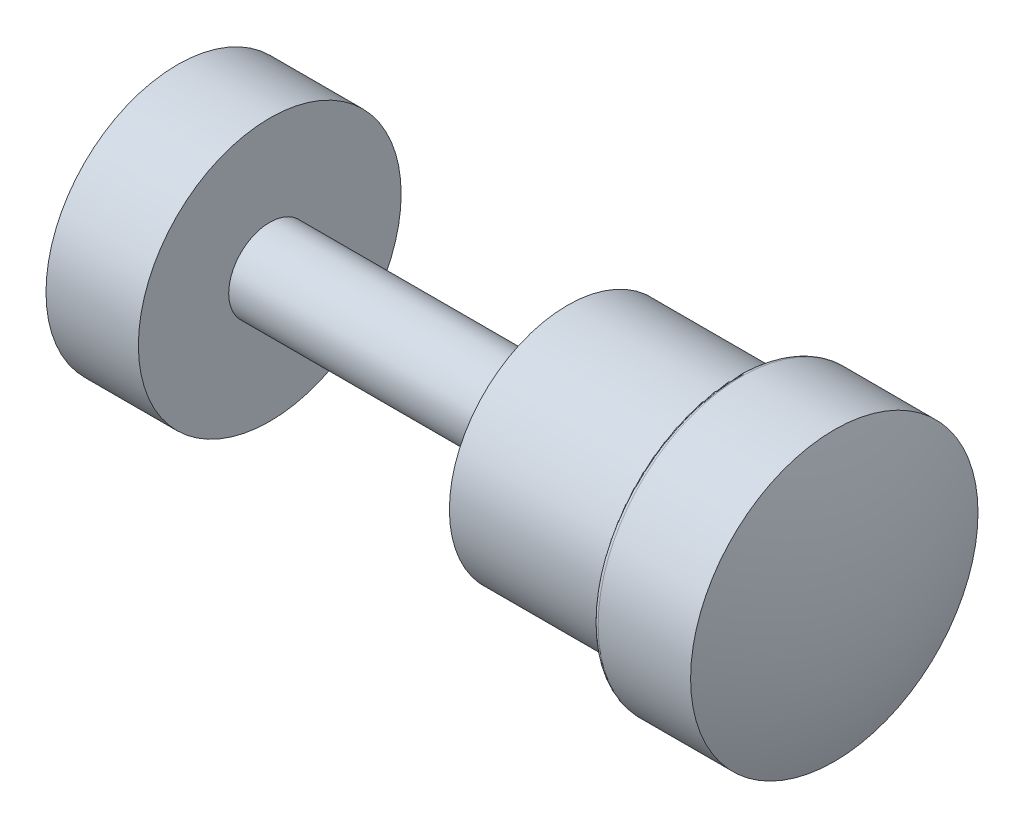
ISO-10303-21;
HEADER;
FILE_DESCRIPTION(('STEP AP214'),'2;1');
FILE_NAME('part.step','',(''),(''),'','','');
FILE_SCHEMA(('AUTOMOTIVE_DESIGN { 1 0 10303 214 1 1 1 1 }'));
ENDSEC;
DATA;
#1=APPLICATION_CONTEXT('core data for automotive mechanical design processes');
#2=APPLICATION_PROTOCOL_DEFINITION('international standard','automotive_design',2000,#1);
#3=PRODUCT_CONTEXT('',#1,'mechanical');
#4=PRODUCT('Part','Part','',(#3));
#5=PRODUCT_RELATED_PRODUCT_CATEGORY('part','',(#4));
#6=PRODUCT_DEFINITION_FORMATION('','',#4);
#7=PRODUCT_DEFINITION_CONTEXT('part definition',#1,'design');
#8=PRODUCT_DEFINITION('design','',#6,#7);
#9=PRODUCT_DEFINITION_SHAPE('','',#8);
#10=(LENGTH_UNIT() NAMED_UNIT(*) SI_UNIT(.MILLI.,.METRE.));
#11=(NAMED_UNIT(*) PLANE_ANGLE_UNIT() SI_UNIT($,.RADIAN.));
#12=(NAMED_UNIT(*) SI_UNIT($,.STERADIAN.) SOLID_ANGLE_UNIT());
#13=UNCERTAINTY_MEASURE_WITH_UNIT(LENGTH_MEASURE(1.E-05),#10,'distance_accuracy_value','');
#14=(GEOMETRIC_REPRESENTATION_CONTEXT(3) GLOBAL_UNCERTAINTY_ASSIGNED_CONTEXT((#13)) GLOBAL_UNIT_ASSIGNED_CONTEXT((#10,
#11,#12)) REPRESENTATION_CONTEXT('',''));
#15=CARTESIAN_POINT('',(0.,0.,0.));
#16=DIRECTION('',(0.,0.,1.));
#17=DIRECTION('',(1.,0.,0.));
#18=AXIS2_PLACEMENT_3D('',#15,#16,#17);
#19=CARTESIAN_POINT('',(-17.5,0.,0.));
#20=DIRECTION('',(1.,0.,0.));
#21=DIRECTION('',(0.,0.,-1.));
#22=AXIS2_PLACEMENT_3D('',#19,#20,#21);
#23=CYLINDRICAL_SURFACE('',#22,2.);
#24=CARTESIAN_POINT('',(0.,0.,0.));
#25=DIRECTION('',(1.,0.,0.));
#26=DIRECTION('',(0.,0.,-1.));
#27=AXIS2_PLACEMENT_3D('',#24,#25,#26);
#28=CIRCLE('',#27,2.);
#29=CARTESIAN_POINT('',(0.,0.,-2.));
#30=VERTEX_POINT('',#29);
#31=EDGE_CURVE('E40',#30,#30,#28,.F.);
#32=ORIENTED_EDGE('',*,*,#31,.T.);
#33=EDGE_LOOP('',(#32));
#34=FACE_BOUND('',#33,.T.);
#35=CARTESIAN_POINT('',(-14.5,0.,0.));
#36=DIRECTION('',(-1.,0.,0.));
#37=DIRECTION('',(0.,0.,1.));
#38=AXIS2_PLACEMENT_3D('',#35,#36,#37);
#39=CIRCLE('',#38,2.);
#40=CARTESIAN_POINT('',(-14.5,0.,2.));
#41=VERTEX_POINT('',#40);
#42=EDGE_CURVE('E10',#41,#41,#39,.T.);
#43=ORIENTED_EDGE('',*,*,#42,.F.);
#44=EDGE_LOOP('',(#43));
#45=FACE_BOUND('',#44,.T.);
#46=ADVANCED_FACE('F33',(#34,#45),#23,.T.);
#47=CARTESIAN_POINT('',(0.,0.,0.));
#48=DIRECTION('',(1.,0.,0.));
#49=DIRECTION('',(0.,0.,-1.));
#50=AXIS2_PLACEMENT_3D('',#47,#48,#49);
#51=PLANE('',#50);
#52=CARTESIAN_POINT('',(0.,0.,0.));
#53=DIRECTION('',(1.,0.,0.));
#54=DIRECTION('',(0.,0.,-1.));
#55=AXIS2_PLACEMENT_3D('',#52,#53,#54);
#56=CIRCLE('',#55,5.75);
#57=CARTESIAN_POINT('',(0.,0.,-5.75));
#58=VERTEX_POINT('',#57);
#59=EDGE_CURVE('E59',#58,#58,#56,.T.);
#60=ORIENTED_EDGE('',*,*,#59,.F.);
#61=EDGE_LOOP('',(#60));
#62=FACE_BOUND('',#61,.T.);
#63=ORIENTED_EDGE('',*,*,#31,.F.);
#64=EDGE_LOOP('',(#63));
#65=FACE_BOUND('',#64,.T.);
#66=ADVANCED_FACE('F95',(#62,#65),#51,.F.);
#67=CARTESIAN_POINT('',(8.,0.,0.));
#68=DIRECTION('',(-1.,0.,0.));
#69=DIRECTION('',(0.,0.,1.));
#70=AXIS2_PLACEMENT_3D('',#67,#68,#69);
#71=CYLINDRICAL_SURFACE('',#70,5.75);
#72=CARTESIAN_POINT('',(7.80290079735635,0.,0.));
#73=DIRECTION('',(1.,0.,0.));
#74=DIRECTION('',(0.,0.,-1.));
#75=AXIS2_PLACEMENT_3D('',#72,#73,#74);
#76=CIRCLE('',#75,5.75);
#77=CARTESIAN_POINT('',(7.80290079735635,0.,-5.75));
#78=VERTEX_POINT('',#77);
#79=EDGE_CURVE('E44',#78,#78,#76,.F.);
#80=ORIENTED_EDGE('',*,*,#79,.T.);
#81=EDGE_LOOP('',(#80));
#82=FACE_BOUND('',#81,.T.);
#83=ORIENTED_EDGE('',*,*,#59,.T.);
#84=EDGE_LOOP('',(#83));
#85=FACE_BOUND('',#84,.T.);
#86=ADVANCED_FACE('F100',(#82,#85),#71,.T.);
#87=CARTESIAN_POINT('',(13.,0.,0.));
#88=DIRECTION('',(-1.,0.,0.));
#89=DIRECTION('',(0.,0.,1.));
#90=AXIS2_PLACEMENT_3D('',#87,#88,#89);
#91=CYLINDRICAL_SURFACE('',#90,7.);
#92=CARTESIAN_POINT('',(8.49709920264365,0.,0.));
#93=DIRECTION('',(-1.,0.,0.));
#94=DIRECTION('',(0.,0.,1.));
#95=AXIS2_PLACEMENT_3D('',#92,#93,#94);
#96=CIRCLE('',#95,7.);
#97=CARTESIAN_POINT('',(8.49709920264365,0.,7.));
#98=VERTEX_POINT('',#97);
#99=EDGE_CURVE('E56',#98,#98,#96,.F.);
#100=ORIENTED_EDGE('',*,*,#99,.T.);
#101=EDGE_LOOP('',(#100));
#102=FACE_BOUND('',#101,.T.);
#103=CARTESIAN_POINT('',(13.,0.,0.));
#104=DIRECTION('',(1.,0.,0.));
#105=DIRECTION('',(0.,0.,-1.));
#106=AXIS2_PLACEMENT_3D('',#103,#104,#105);
#107=CIRCLE('',#106,7.);
#108=CARTESIAN_POINT('',(13.,0.,-7.));
#109=VERTEX_POINT('',#108);
#110=EDGE_CURVE('E60',#109,#109,#107,.T.);
#111=ORIENTED_EDGE('',*,*,#110,.F.);
#112=EDGE_LOOP('',(#111));
#113=FACE_BOUND('',#112,.T.);
#114=ADVANCED_FACE('F106',(#102,#113),#91,.T.);
#115=CARTESIAN_POINT('',(-5.97500000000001,0.,0.));
#116=DIRECTION('',(0.,0.,1.));
#117=DIRECTION('',(1.,0.,0.));
#118=AXIS2_PLACEMENT_3D('',#115,#116,#117);
#119=SPHERICAL_SURFACE('',#118,20.225);
#120=CARTESIAN_POINT('',(-5.97500000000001,0.,0.));
#121=DIRECTION('',(1.,0.,0.));
#122=DIRECTION('',(0.,0.,-1.));
#123=AXIS2_PLACEMENT_3D('',#120,#121,#122);
#124=SPHERICAL_SURFACE('',#123,20.225);
#125=ORIENTED_EDGE('',*,*,#110,.T.);
#126=EDGE_LOOP('',(#125));
#127=FACE_BOUND('',#126,.T.);
#128=ADVANCED_FACE('F108',(#127),#124,.T.);
#129=CARTESIAN_POINT('',(8.3,0.,0.));
#130=DIRECTION('',(1.,0.,0.));
#131=DIRECTION('',(0.,0.,-1.));
#132=AXIS2_PLACEMENT_3D('',#129,#130,#131);
#133=CONICAL_SURFACE('',#132,7.,1.33525134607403);
#134=CARTESIAN_POINT('',(8.25400237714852,0.,0.));
#135=DIRECTION('',(1.,0.,0.));
#136=DIRECTION('',(0.,0.,-1.));
#137=AXIS2_PLACEMENT_3D('',#134,#135,#136);
#138=CIRCLE('',#137,6.80834323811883);
#139=CARTESIAN_POINT('',(8.25400237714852,0.,-6.80834323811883));
#140=VERTEX_POINT('',#139);
#141=EDGE_CURVE('E48',#140,#140,#138,.F.);
#142=ORIENTED_EDGE('',*,*,#141,.T.);
#143=EDGE_LOOP('',(#142));
#144=FACE_BOUND('',#143,.T.);
#145=CARTESIAN_POINT('',(8.04599762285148,0.,0.));
#146=DIRECTION('',(-1.,0.,0.));
#147=DIRECTION('',(0.,0.,1.));
#148=AXIS2_PLACEMENT_3D('',#145,#146,#147);
#149=CIRCLE('',#148,5.94165676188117);
#150=CARTESIAN_POINT('',(8.04599762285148,0.,5.94165676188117));
#151=VERTEX_POINT('',#150);
#152=EDGE_CURVE('E53',#151,#151,#149,.F.);
#153=ORIENTED_EDGE('',*,*,#152,.T.);
#154=EDGE_LOOP('',(#153));
#155=FACE_BOUND('',#154,.T.);
#156=ADVANCED_FACE('F116',(#144,#155),#133,.T.);
#157=CARTESIAN_POINT('',(8.49709920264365,0.,0.));
#158=DIRECTION('',(-1.,0.,0.));
#159=DIRECTION('',(0.,0.,1.));
#160=AXIS2_PLACEMENT_3D('',#157,#158,#159);
#161=TOROIDAL_SURFACE('',#160,6.75,0.25);
#162=ORIENTED_EDGE('',*,*,#141,.F.);
#163=EDGE_LOOP('',(#162));
#164=FACE_BOUND('',#163,.T.);
#165=ORIENTED_EDGE('',*,*,#99,.F.);
#166=EDGE_LOOP('',(#165));
#167=FACE_BOUND('',#166,.T.);
#168=ADVANCED_FACE('F119',(#164,#167),#161,.T.);
#169=CARTESIAN_POINT('',(7.80290079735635,0.,0.));
#170=DIRECTION('',(1.,0.,0.));
#171=DIRECTION('',(0.,0.,-1.));
#172=AXIS2_PLACEMENT_3D('',#169,#170,#171);
#173=TOROIDAL_SURFACE('',#172,6.,0.25);
#174=ORIENTED_EDGE('',*,*,#79,.F.);
#175=EDGE_LOOP('',(#174));
#176=FACE_BOUND('',#175,.T.);
#177=ORIENTED_EDGE('',*,*,#152,.F.);
#178=EDGE_LOOP('',(#177));
#179=FACE_BOUND('',#178,.T.);
#180=ADVANCED_FACE('F35',(#176,#179),#173,.F.);
#181=CARTESIAN_POINT('',(-19.,0.,0.));
#182=DIRECTION('',(-1.,0.,0.));
#183=DIRECTION('',(0.,0.,1.));
#184=AXIS2_PLACEMENT_3D('',#181,#182,#183);
#185=PLANE('',#184);
#186=CARTESIAN_POINT('',(-19.,0.,0.));
#187=DIRECTION('',(-1.,0.,0.));
#188=DIRECTION('',(0.,0.,1.));
#189=AXIS2_PLACEMENT_3D('',#186,#187,#188);
#190=CIRCLE('',#189,6.4);
#191=CARTESIAN_POINT('',(-19.,0.,6.4));
#192=VERTEX_POINT('',#191);
#193=EDGE_CURVE('E68',#192,#192,#190,.T.);
#194=ORIENTED_EDGE('',*,*,#193,.T.);
#195=EDGE_LOOP('',(#194));
#196=FACE_BOUND('',#195,.T.);
#197=CARTESIAN_POINT('',(-19.,0.,0.));
#198=DIRECTION('',(-1.,0.,0.));
#199=DIRECTION('',(0.,0.,1.));
#200=AXIS2_PLACEMENT_3D('',#197,#198,#199);
#201=CIRCLE('',#200,2.);
#202=CARTESIAN_POINT('',(-19.,0.,2.));
#203=VERTEX_POINT('',#202);
#204=EDGE_CURVE('E72',#203,#203,#201,.T.);
#205=ORIENTED_EDGE('',*,*,#204,.F.);
#206=EDGE_LOOP('',(#205));
#207=FACE_BOUND('',#206,.T.);
#208=ADVANCED_FACE('F126',(#196,#207),#185,.T.);
#209=CARTESIAN_POINT('',(-19.,0.,0.));
#210=DIRECTION('',(1.,0.,0.));
#211=DIRECTION('',(0.,0.,-1.));
#212=AXIS2_PLACEMENT_3D('',#209,#210,#211);
#213=CYLINDRICAL_SURFACE('',#212,6.4);
#214=ORIENTED_EDGE('',*,*,#193,.F.);
#215=EDGE_LOOP('',(#214));
#216=FACE_BOUND('',#215,.T.);
#217=CARTESIAN_POINT('',(-14.5,0.,0.));
#218=DIRECTION('',(-1.,0.,0.));
#219=DIRECTION('',(0.,0.,1.));
#220=AXIS2_PLACEMENT_3D('',#217,#218,#219);
#221=CIRCLE('',#220,6.4);
#222=CARTESIAN_POINT('',(-14.5,0.,6.4));
#223=VERTEX_POINT('',#222);
#224=EDGE_CURVE('E75',#223,#223,#221,.T.);
#225=ORIENTED_EDGE('',*,*,#224,.T.);
#226=EDGE_LOOP('',(#225));
#227=FACE_BOUND('',#226,.T.);
#228=ADVANCED_FACE('F79',(#216,#227),#213,.T.);
#229=CARTESIAN_POINT('',(-19.,0.,0.));
#230=DIRECTION('',(1.,0.,0.));
#231=DIRECTION('',(0.,0.,-1.));
#232=AXIS2_PLACEMENT_3D('',#229,#230,#231);
#233=CYLINDRICAL_SURFACE('',#232,2.);
#234=CARTESIAN_POINT('',(-17.5,0.,0.));
#235=DIRECTION('',(-1.,0.,0.));
#236=DIRECTION('',(0.,0.,1.));
#237=AXIS2_PLACEMENT_3D('',#234,#235,#236);
#238=CIRCLE('',#237,2.);
#239=CARTESIAN_POINT('',(-17.5,0.,2.));
#240=VERTEX_POINT('',#239);
#241=EDGE_CURVE('E63',#240,#240,#238,.F.);
#242=ORIENTED_EDGE('',*,*,#241,.T.);
#243=EDGE_LOOP('',(#242));
#244=FACE_BOUND('',#243,.T.);
#245=ORIENTED_EDGE('',*,*,#204,.T.);
#246=EDGE_LOOP('',(#245));
#247=FACE_BOUND('',#246,.T.);
#248=ADVANCED_FACE('F84',(#244,#247),#233,.F.);
#249=CARTESIAN_POINT('',(-14.5,0.,0.));
#250=DIRECTION('',(-1.,0.,0.));
#251=DIRECTION('',(0.,0.,1.));
#252=AXIS2_PLACEMENT_3D('',#249,#250,#251);
#253=PLANE('',#252);
#254=ORIENTED_EDGE('',*,*,#42,.T.);
#255=EDGE_LOOP('',(#254));
#256=FACE_BOUND('',#255,.T.);
#257=ORIENTED_EDGE('',*,*,#224,.F.);
#258=EDGE_LOOP('',(#257));
#259=FACE_BOUND('',#258,.T.);
#260=ADVANCED_FACE('F81',(#256,#259),#253,.F.);
#261=CARTESIAN_POINT('',(-17.5,0.,0.));
#262=DIRECTION('',(-1.,0.,0.));
#263=DIRECTION('',(0.,0.,1.));
#264=AXIS2_PLACEMENT_3D('',#261,#262,#263);
#265=PLANE('',#264);
#266=ORIENTED_EDGE('',*,*,#241,.F.);
#267=EDGE_LOOP('',(#266));
#268=FACE_BOUND('',#267,.T.);
#269=ADVANCED_FACE('F83',(#268),#265,.T.);
#270=CLOSED_SHELL('',(#46,#66,#86,#114,#128,#156,#168,#180,#208,#228,#248,#260,#269));
#271=MANIFOLD_SOLID_BREP('B2',#270);
#272=ADVANCED_BREP_SHAPE_REPRESENTATION('',(#18,#271),#14);
#273=SHAPE_DEFINITION_REPRESENTATION(#9,#272);
ENDSEC;
END-ISO-10303-21;
